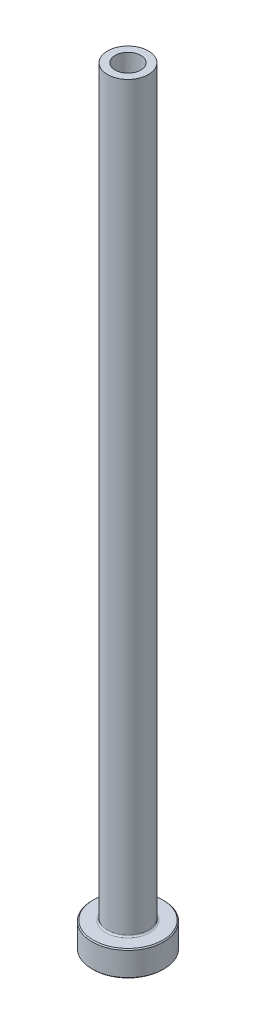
ISO-10303-21;
HEADER;
FILE_DESCRIPTION(('STEP AP214'),'2;1');
FILE_NAME('part.step','',(''),(''),'','','');
FILE_SCHEMA(('AUTOMOTIVE_DESIGN { 1 0 10303 214 1 1 1 1 }'));
ENDSEC;
DATA;
#1=APPLICATION_CONTEXT('core data for automotive mechanical design processes');
#2=APPLICATION_PROTOCOL_DEFINITION('international standard','automotive_design',2000,#1);
#3=PRODUCT_CONTEXT('',#1,'mechanical');
#4=PRODUCT('Part','Part','',(#3));
#5=PRODUCT_RELATED_PRODUCT_CATEGORY('part','',(#4));
#6=PRODUCT_DEFINITION_FORMATION('','',#4);
#7=PRODUCT_DEFINITION_CONTEXT('part definition',#1,'design');
#8=PRODUCT_DEFINITION('design','',#6,#7);
#9=PRODUCT_DEFINITION_SHAPE('','',#8);
#10=(LENGTH_UNIT() NAMED_UNIT(*) SI_UNIT(.MILLI.,.METRE.));
#11=(NAMED_UNIT(*) PLANE_ANGLE_UNIT() SI_UNIT($,.RADIAN.));
#12=(NAMED_UNIT(*) SI_UNIT($,.STERADIAN.) SOLID_ANGLE_UNIT());
#13=UNCERTAINTY_MEASURE_WITH_UNIT(LENGTH_MEASURE(1.E-05),#10,'distance_accuracy_value','');
#14=(GEOMETRIC_REPRESENTATION_CONTEXT(3) GLOBAL_UNCERTAINTY_ASSIGNED_CONTEXT((#13)) GLOBAL_UNIT_ASSIGNED_CONTEXT((#10,
#11,#12)) REPRESENTATION_CONTEXT('',''));
#15=CARTESIAN_POINT('',(0.,0.,0.));
#16=DIRECTION('',(0.,0.,1.));
#17=DIRECTION('',(1.,0.,0.));
#18=AXIS2_PLACEMENT_3D('',#15,#16,#17);
#19=CARTESIAN_POINT('',(0.,92.1876809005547,0.));
#20=DIRECTION('',(0.,1.,0.));
#21=DIRECTION('',(0.,0.,1.));
#22=AXIS2_PLACEMENT_3D('',#19,#20,#21);
#23=CYLINDRICAL_SURFACE('',#22,2.5);
#24=CARTESIAN_POINT('',(0.,150.,0.));
#25=DIRECTION('',(0.,1.,0.));
#26=DIRECTION('',(0.,0.,1.));
#27=AXIS2_PLACEMENT_3D('',#24,#25,#26);
#28=CIRCLE('',#27,2.5);
#29=CARTESIAN_POINT('',(0.,150.,2.5));
#30=VERTEX_POINT('',#29);
#31=EDGE_CURVE('E62',#30,#30,#28,.T.);
#32=ORIENTED_EDGE('',*,*,#31,.T.);
#33=EDGE_LOOP('',(#32));
#34=FACE_BOUND('',#33,.T.);
#35=CARTESIAN_POINT('',(0.,105.,0.));
#36=DIRECTION('',(0.,1.,0.));
#37=DIRECTION('',(0.,0.,1.));
#38=AXIS2_PLACEMENT_3D('',#35,#36,#37);
#39=CIRCLE('',#38,2.5);
#40=CARTESIAN_POINT('',(0.,105.,2.5));
#41=VERTEX_POINT('',#40);
#42=EDGE_CURVE('E71',#41,#41,#39,.T.);
#43=ORIENTED_EDGE('',*,*,#42,.F.);
#44=EDGE_LOOP('',(#43));
#45=FACE_BOUND('',#44,.T.);
#46=ADVANCED_FACE('F30',(#34,#45),#23,.F.);
#47=CARTESIAN_POINT('',(-2.5,150.,0.));
#48=DIRECTION('',(0.,1.,0.));
#49=DIRECTION('',(0.,0.,1.));
#50=AXIS2_PLACEMENT_3D('',#47,#48,#49);
#51=PLANE('',#50);
#52=CARTESIAN_POINT('',(0.,150.,0.));
#53=DIRECTION('',(0.,1.,0.));
#54=DIRECTION('',(0.,0.,1.));
#55=AXIS2_PLACEMENT_3D('',#52,#53,#54);
#56=CIRCLE('',#55,4.00000000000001);
#57=CARTESIAN_POINT('',(0.,150.,4.00000000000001));
#58=VERTEX_POINT('',#57);
#59=EDGE_CURVE('E65',#58,#58,#56,.T.);
#60=ORIENTED_EDGE('',*,*,#59,.T.);
#61=EDGE_LOOP('',(#60));
#62=FACE_BOUND('',#61,.T.);
#63=ORIENTED_EDGE('',*,*,#31,.F.);
#64=EDGE_LOOP('',(#63));
#65=FACE_BOUND('',#64,.T.);
#66=ADVANCED_FACE('F79',(#62,#65),#51,.T.);
#67=CARTESIAN_POINT('',(0.,92.1876809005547,0.));
#68=DIRECTION('',(0.,1.,0.));
#69=DIRECTION('',(0.,0.,1.));
#70=AXIS2_PLACEMENT_3D('',#67,#68,#69);
#71=CYLINDRICAL_SURFACE('',#70,4.);
#72=CARTESIAN_POINT('',(0.,5.3,0.));
#73=DIRECTION('',(0.,1.,0.));
#74=DIRECTION('',(0.,0.,1.));
#75=AXIS2_PLACEMENT_3D('',#72,#73,#74);
#76=CIRCLE('',#75,4.);
#77=CARTESIAN_POINT('',(0.,5.3,4.));
#78=VERTEX_POINT('',#77);
#79=EDGE_CURVE('E59',#78,#78,#76,.T.);
#80=ORIENTED_EDGE('',*,*,#79,.T.);
#81=EDGE_LOOP('',(#80));
#82=FACE_BOUND('',#81,.T.);
#83=ORIENTED_EDGE('',*,*,#59,.F.);
#84=EDGE_LOOP('',(#83));
#85=FACE_BOUND('',#84,.T.);
#86=ADVANCED_FACE('F85',(#82,#85),#71,.T.);
#87=CARTESIAN_POINT('',(-3.99999999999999,5.,0.));
#88=DIRECTION('',(0.,1.,0.));
#89=DIRECTION('',(0.,0.,1.));
#90=AXIS2_PLACEMENT_3D('',#87,#88,#89);
#91=PLANE('',#90);
#92=CARTESIAN_POINT('',(0.,5.,0.));
#93=DIRECTION('',(0.,1.,0.));
#94=DIRECTION('',(0.,0.,1.));
#95=AXIS2_PLACEMENT_3D('',#92,#93,#94);
#96=CIRCLE('',#95,6.8);
#97=CARTESIAN_POINT('',(0.,5.,6.8));
#98=VERTEX_POINT('',#97);
#99=EDGE_CURVE('E53',#98,#98,#96,.T.);
#100=ORIENTED_EDGE('',*,*,#99,.T.);
#101=EDGE_LOOP('',(#100));
#102=FACE_BOUND('',#101,.T.);
#103=CARTESIAN_POINT('',(0.,5.,0.));
#104=DIRECTION('',(0.,1.,0.));
#105=DIRECTION('',(0.,0.,1.));
#106=AXIS2_PLACEMENT_3D('',#103,#104,#105);
#107=CIRCLE('',#106,4.3);
#108=CARTESIAN_POINT('',(0.,5.,4.3));
#109=VERTEX_POINT('',#108);
#110=EDGE_CURVE('E56',#109,#109,#107,.F.);
#111=ORIENTED_EDGE('',*,*,#110,.T.);
#112=EDGE_LOOP('',(#111));
#113=FACE_BOUND('',#112,.T.);
#114=ADVANCED_FACE('F111',(#102,#113),#91,.T.);
#115=CARTESIAN_POINT('',(0.,92.1876809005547,0.));
#116=DIRECTION('',(0.,1.,0.));
#117=DIRECTION('',(0.,0.,1.));
#118=AXIS2_PLACEMENT_3D('',#115,#116,#117);
#119=CYLINDRICAL_SURFACE('',#118,6.99999999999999);
#120=CARTESIAN_POINT('',(0.,4.8,0.));
#121=DIRECTION('',(0.,1.,0.));
#122=DIRECTION('',(0.,0.,1.));
#123=AXIS2_PLACEMENT_3D('',#120,#121,#122);
#124=CIRCLE('',#123,6.99999999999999);
#125=CARTESIAN_POINT('',(0.,4.8,6.99999999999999));
#126=VERTEX_POINT('',#125);
#127=EDGE_CURVE('E45',#126,#126,#124,.F.);
#128=ORIENTED_EDGE('',*,*,#127,.T.);
#129=EDGE_LOOP('',(#128));
#130=FACE_BOUND('',#129,.T.);
#131=CARTESIAN_POINT('',(0.,0.200000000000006,0.));
#132=DIRECTION('',(0.,-1.,0.));
#133=DIRECTION('',(0.,0.,-1.));
#134=AXIS2_PLACEMENT_3D('',#131,#132,#133);
#135=CIRCLE('',#134,6.99999999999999);
#136=CARTESIAN_POINT('',(0.,0.200000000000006,-6.99999999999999));
#137=VERTEX_POINT('',#136);
#138=EDGE_CURVE('E50',#137,#137,#135,.F.);
#139=ORIENTED_EDGE('',*,*,#138,.T.);
#140=EDGE_LOOP('',(#139));
#141=FACE_BOUND('',#140,.T.);
#142=ADVANCED_FACE('F108',(#130,#141),#119,.T.);
#143=CARTESIAN_POINT('',(-6.99999999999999,0.,0.));
#144=DIRECTION('',(0.,-1.,0.));
#145=DIRECTION('',(0.,0.,-1.));
#146=AXIS2_PLACEMENT_3D('',#143,#144,#145);
#147=PLANE('',#146);
#148=CARTESIAN_POINT('',(0.,0.,0.));
#149=DIRECTION('',(0.,-1.,0.));
#150=DIRECTION('',(0.,0.,-1.));
#151=AXIS2_PLACEMENT_3D('',#148,#149,#150);
#152=CIRCLE('',#151,3.24999999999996);
#153=CARTESIAN_POINT('',(0.,0.,-3.24999999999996));
#154=VERTEX_POINT('',#153);
#155=EDGE_CURVE('E37',#154,#154,#152,.F.);
#156=ORIENTED_EDGE('',*,*,#155,.T.);
#157=EDGE_LOOP('',(#156));
#158=FACE_BOUND('',#157,.T.);
#159=CARTESIAN_POINT('',(0.,0.,0.));
#160=DIRECTION('',(0.,-1.,0.));
#161=DIRECTION('',(0.,0.,-1.));
#162=AXIS2_PLACEMENT_3D('',#159,#160,#161);
#163=CIRCLE('',#162,6.79999999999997);
#164=CARTESIAN_POINT('',(0.,0.,-6.79999999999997));
#165=VERTEX_POINT('',#164);
#166=EDGE_CURVE('E41',#165,#165,#163,.T.);
#167=ORIENTED_EDGE('',*,*,#166,.T.);
#168=EDGE_LOOP('',(#167));
#169=FACE_BOUND('',#168,.T.);
#170=ADVANCED_FACE('F110',(#158,#169),#147,.T.);
#171=CARTESIAN_POINT('',(0.,92.1876809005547,0.));
#172=DIRECTION('',(0.,1.,0.));
#173=DIRECTION('',(0.,0.,1.));
#174=AXIS2_PLACEMENT_3D('',#171,#172,#173);
#175=CYLINDRICAL_SURFACE('',#174,2.75);
#176=CARTESIAN_POINT('',(0.,0.499999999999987,0.));
#177=DIRECTION('',(0.,-1.,0.));
#178=DIRECTION('',(0.,0.,-1.));
#179=AXIS2_PLACEMENT_3D('',#176,#177,#178);
#180=CIRCLE('',#179,2.75);
#181=CARTESIAN_POINT('',(0.,0.499999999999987,-2.75));
#182=VERTEX_POINT('',#181);
#183=EDGE_CURVE('E10',#182,#182,#180,.T.);
#184=ORIENTED_EDGE('',*,*,#183,.T.);
#185=EDGE_LOOP('',(#184));
#186=FACE_BOUND('',#185,.T.);
#187=CARTESIAN_POINT('',(0.,93.,0.));
#188=DIRECTION('',(0.,1.,0.));
#189=DIRECTION('',(0.,0.,1.));
#190=AXIS2_PLACEMENT_3D('',#187,#188,#189);
#191=CIRCLE('',#190,2.75);
#192=CARTESIAN_POINT('',(0.,93.,2.75));
#193=VERTEX_POINT('',#192);
#194=EDGE_CURVE('E68',#193,#193,#191,.T.);
#195=ORIENTED_EDGE('',*,*,#194,.T.);
#196=EDGE_LOOP('',(#195));
#197=FACE_BOUND('',#196,.T.);
#198=ADVANCED_FACE('F118',(#186,#197),#175,.F.);
#199=CARTESIAN_POINT('',(0.,93.,0.));
#200=DIRECTION('',(0.,-1.,0.));
#201=DIRECTION('',(0.,0.,-1.));
#202=AXIS2_PLACEMENT_3D('',#199,#200,#201);
#203=CONICAL_SURFACE('',#202,2.75,0.0208303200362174);
#204=ORIENTED_EDGE('',*,*,#42,.T.);
#205=EDGE_LOOP('',(#204));
#206=FACE_BOUND('',#205,.T.);
#207=ORIENTED_EDGE('',*,*,#194,.F.);
#208=EDGE_LOOP('',(#207));
#209=FACE_BOUND('',#208,.T.);
#210=ADVANCED_FACE('F75',(#206,#209),#203,.F.);
#211=CARTESIAN_POINT('',(0.,5.3,0.));
#212=DIRECTION('',(0.,1.,0.));
#213=DIRECTION('',(0.,0.,1.));
#214=AXIS2_PLACEMENT_3D('',#211,#212,#213);
#215=TOROIDAL_SURFACE('',#214,4.3,0.3);
#216=ORIENTED_EDGE('',*,*,#110,.F.);
#217=EDGE_LOOP('',(#216));
#218=FACE_BOUND('',#217,.T.);
#219=ORIENTED_EDGE('',*,*,#79,.F.);
#220=EDGE_LOOP('',(#219));
#221=FACE_BOUND('',#220,.T.);
#222=ADVANCED_FACE('F90',(#218,#221),#215,.F.);
#223=CARTESIAN_POINT('',(0.,5.,0.));
#224=DIRECTION('',(0.,-1.,0.));
#225=DIRECTION('',(0.,0.,-1.));
#226=AXIS2_PLACEMENT_3D('',#223,#224,#225);
#227=CONICAL_SURFACE('',#226,6.8,0.785398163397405);
#228=ORIENTED_EDGE('',*,*,#127,.F.);
#229=EDGE_LOOP('',(#228));
#230=FACE_BOUND('',#229,.T.);
#231=ORIENTED_EDGE('',*,*,#99,.F.);
#232=EDGE_LOOP('',(#231));
#233=FACE_BOUND('',#232,.T.);
#234=ADVANCED_FACE('F93',(#230,#233),#227,.T.);
#235=CARTESIAN_POINT('',(0.,0.200000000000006,0.));
#236=DIRECTION('',(0.,1.,0.));
#237=DIRECTION('',(0.,0.,1.));
#238=AXIS2_PLACEMENT_3D('',#235,#236,#237);
#239=CONICAL_SURFACE('',#238,6.99999999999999,0.785398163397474);
#240=ORIENTED_EDGE('',*,*,#166,.F.);
#241=EDGE_LOOP('',(#240));
#242=FACE_BOUND('',#241,.T.);
#243=ORIENTED_EDGE('',*,*,#138,.F.);
#244=EDGE_LOOP('',(#243));
#245=FACE_BOUND('',#244,.T.);
#246=ADVANCED_FACE('F96',(#242,#245),#239,.T.);
#247=CARTESIAN_POINT('',(0.,0.,0.));
#248=DIRECTION('',(0.,-1.,0.));
#249=DIRECTION('',(0.,0.,-1.));
#250=AXIS2_PLACEMENT_3D('',#247,#248,#249);
#251=CONICAL_SURFACE('',#250,3.24999999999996,0.785398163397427);
#252=ORIENTED_EDGE('',*,*,#183,.F.);
#253=EDGE_LOOP('',(#252));
#254=FACE_BOUND('',#253,.T.);
#255=ORIENTED_EDGE('',*,*,#155,.F.);
#256=EDGE_LOOP('',(#255));
#257=FACE_BOUND('',#256,.T.);
#258=ADVANCED_FACE('F32',(#254,#257),#251,.F.);
#259=CLOSED_SHELL('',(#46,#66,#86,#114,#142,#170,#198,#210,#222,#234,#246,#258));
#260=MANIFOLD_SOLID_BREP('B2',#259);
#261=ADVANCED_BREP_SHAPE_REPRESENTATION('',(#18,#260),#14);
#262=SHAPE_DEFINITION_REPRESENTATION(#9,#261);
ENDSEC;
END-ISO-10303-21;
